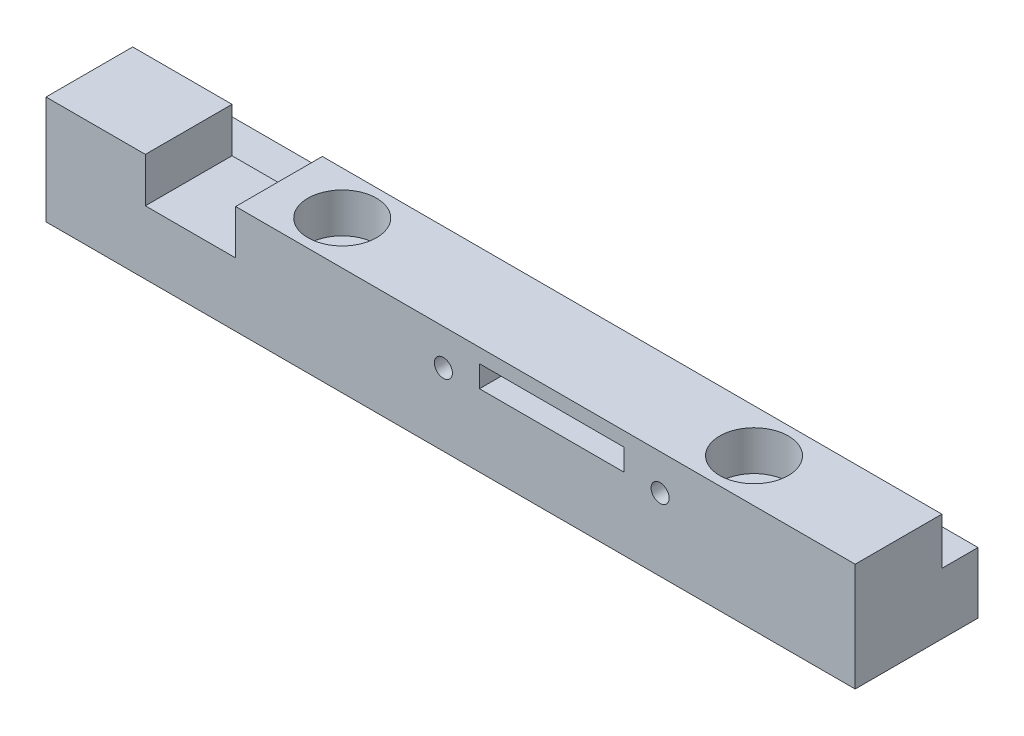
ISO-10303-21;
HEADER;
FILE_DESCRIPTION(('STEP AP214'),'2;1');
FILE_NAME('part.step','',(''),(''),'','','');
FILE_SCHEMA(('AUTOMOTIVE_DESIGN { 1 0 10303 214 1 1 1 1 }'));
ENDSEC;
DATA;
#1=APPLICATION_CONTEXT('core data for automotive mechanical design processes');
#2=APPLICATION_PROTOCOL_DEFINITION('international standard','automotive_design',2000,#1);
#3=PRODUCT_CONTEXT('',#1,'mechanical');
#4=PRODUCT('Part','Part','',(#3));
#5=PRODUCT_RELATED_PRODUCT_CATEGORY('part','',(#4));
#6=PRODUCT_DEFINITION_FORMATION('','',#4);
#7=PRODUCT_DEFINITION_CONTEXT('part definition',#1,'design');
#8=PRODUCT_DEFINITION('design','',#6,#7);
#9=PRODUCT_DEFINITION_SHAPE('','',#8);
#10=(LENGTH_UNIT() NAMED_UNIT(*) SI_UNIT(.MILLI.,.METRE.));
#11=(NAMED_UNIT(*) PLANE_ANGLE_UNIT() SI_UNIT($,.RADIAN.));
#12=(NAMED_UNIT(*) SI_UNIT($,.STERADIAN.) SOLID_ANGLE_UNIT());
#13=UNCERTAINTY_MEASURE_WITH_UNIT(LENGTH_MEASURE(1.E-05),#10,'distance_accuracy_value','');
#14=(GEOMETRIC_REPRESENTATION_CONTEXT(3) GLOBAL_UNCERTAINTY_ASSIGNED_CONTEXT((#13)) GLOBAL_UNIT_ASSIGNED_CONTEXT((#10,
#11,#12)) REPRESENTATION_CONTEXT('',''));
#15=CARTESIAN_POINT('',(0.,0.,0.));
#16=DIRECTION('',(0.,0.,1.));
#17=DIRECTION('',(1.,0.,0.));
#18=AXIS2_PLACEMENT_3D('',#15,#16,#17);
#19=CARTESIAN_POINT('',(-0.001000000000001,14.9689235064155,17.));
#20=DIRECTION('',(0.,1.,0.));
#21=DIRECTION('',(0.,0.,1.));
#22=AXIS2_PLACEMENT_3D('',#19,#20,#21);
#23=PLANE('',#22);
#24=DIRECTION('',(0.,0.,1.));
#25=VECTOR('',#24,1.);
#26=CARTESIAN_POINT('',(13.75,14.9689235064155,17.));
#27=LINE('',#26,#25);
#28=CARTESIAN_POINT('',(13.75,14.9689235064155,5.));
#29=VERTEX_POINT('',#28);
#30=CARTESIAN_POINT('',(13.75,14.9689235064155,17.));
#31=VERTEX_POINT('',#30);
#32=EDGE_CURVE('E157',#29,#31,#27,.T.);
#33=ORIENTED_EDGE('',*,*,#32,.F.);
#34=DIRECTION('',(1.,0.,0.));
#35=VECTOR('',#34,1.);
#36=CARTESIAN_POINT('',(-0.001000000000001,14.9689235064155,5.));
#37=LINE('',#36,#35);
#38=CARTESIAN_POINT('',(0.,14.9689235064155,5.));
#39=VERTEX_POINT('',#38);
#40=EDGE_CURVE('E235',#39,#29,#37,.T.);
#41=ORIENTED_EDGE('',*,*,#40,.F.);
#42=DIRECTION('',(0.,0.,-1.));
#43=VECTOR('',#42,1.);
#44=CARTESIAN_POINT('',(0.,14.9689235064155,17.));
#45=LINE('',#44,#43);
#46=CARTESIAN_POINT('',(0.,14.9689235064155,17.));
#47=VERTEX_POINT('',#46);
#48=EDGE_CURVE('E212',#47,#39,#45,.T.);
#49=ORIENTED_EDGE('',*,*,#48,.F.);
#50=DIRECTION('',(1.,0.,0.));
#51=VECTOR('',#50,1.);
#52=CARTESIAN_POINT('',(-0.001000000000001,14.9689235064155,17.));
#53=LINE('',#52,#51);
#54=EDGE_CURVE('E231',#47,#31,#53,.T.);
#55=ORIENTED_EDGE('',*,*,#54,.T.);
#56=EDGE_LOOP('',(#33,#41,#49,#55));
#57=FACE_BOUND('',#56,.T.);
#58=ADVANCED_FACE('F32',(#57),#23,.T.);
#59=CARTESIAN_POINT('',(92.,0.,11.));
#60=DIRECTION('',(0.,1.,0.));
#61=DIRECTION('',(0.,0.,1.));
#62=AXIS2_PLACEMENT_3D('',#59,#60,#61);
#63=CYLINDRICAL_SURFACE('',#62,2.75);
#64=CARTESIAN_POINT('',(92.,0.,11.));
#65=DIRECTION('',(0.,1.,0.));
#66=DIRECTION('',(0.,0.,1.));
#67=AXIS2_PLACEMENT_3D('',#64,#65,#66);
#68=CIRCLE('',#67,2.75);
#69=CARTESIAN_POINT('',(92.,0.,13.75));
#70=VERTEX_POINT('',#69);
#71=EDGE_CURVE('E196',#70,#70,#68,.T.);
#72=ORIENTED_EDGE('',*,*,#71,.F.);
#73=EDGE_LOOP('',(#72));
#74=FACE_BOUND('',#73,.T.);
#75=CARTESIAN_POINT('',(92.,9.46892350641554,11.));
#76=DIRECTION('',(0.,1.,0.));
#77=DIRECTION('',(0.,0.,1.));
#78=AXIS2_PLACEMENT_3D('',#75,#76,#77);
#79=CIRCLE('',#78,2.75);
#80=CARTESIAN_POINT('',(92.,9.46892350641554,13.75));
#81=VERTEX_POINT('',#80);
#82=EDGE_CURVE('E186',#81,#81,#79,.F.);
#83=ORIENTED_EDGE('',*,*,#82,.F.);
#84=EDGE_LOOP('',(#83));
#85=FACE_BOUND('',#84,.T.);
#86=ADVANCED_FACE('F310',(#74,#85),#63,.F.);
#87=CARTESIAN_POINT('',(35.,0.,11.));
#88=DIRECTION('',(0.,1.,0.));
#89=DIRECTION('',(0.,0.,1.));
#90=AXIS2_PLACEMENT_3D('',#87,#88,#89);
#91=CYLINDRICAL_SURFACE('',#90,2.75);
#92=CARTESIAN_POINT('',(35.,0.,11.));
#93=DIRECTION('',(0.,1.,0.));
#94=DIRECTION('',(0.,0.,1.));
#95=AXIS2_PLACEMENT_3D('',#92,#93,#94);
#96=CIRCLE('',#95,2.75);
#97=CARTESIAN_POINT('',(35.,0.,13.75));
#98=VERTEX_POINT('',#97);
#99=EDGE_CURVE('E199',#98,#98,#96,.T.);
#100=ORIENTED_EDGE('',*,*,#99,.F.);
#101=EDGE_LOOP('',(#100));
#102=FACE_BOUND('',#101,.T.);
#103=CARTESIAN_POINT('',(35.,9.46892350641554,11.));
#104=DIRECTION('',(0.,1.,0.));
#105=DIRECTION('',(0.,0.,1.));
#106=AXIS2_PLACEMENT_3D('',#103,#104,#105);
#107=CIRCLE('',#106,2.75);
#108=CARTESIAN_POINT('',(35.,9.46892350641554,13.75));
#109=VERTEX_POINT('',#108);
#110=EDGE_CURVE('E192',#109,#109,#107,.F.);
#111=ORIENTED_EDGE('',*,*,#110,.F.);
#112=EDGE_LOOP('',(#111));
#113=FACE_BOUND('',#112,.T.);
#114=ADVANCED_FACE('F317',(#102,#113),#91,.F.);
#115=CARTESIAN_POINT('',(0.,0.,17.));
#116=DIRECTION('',(0.,1.,0.));
#117=DIRECTION('',(0.,0.,1.));
#118=AXIS2_PLACEMENT_3D('',#115,#116,#117);
#119=PLANE('',#118);
#120=ORIENTED_EDGE('',*,*,#71,.T.);
#121=EDGE_LOOP('',(#120));
#122=FACE_BOUND('',#121,.T.);
#123=ORIENTED_EDGE('',*,*,#99,.T.);
#124=EDGE_LOOP('',(#123));
#125=FACE_BOUND('',#124,.T.);
#126=DIRECTION('',(1.,0.,0.));
#127=VECTOR('',#126,1.);
#128=CARTESIAN_POINT('',(0.,0.,0.));
#129=LINE('',#128,#127);
#130=CARTESIAN_POINT('',(0.,0.,0.));
#131=VERTEX_POINT('',#130);
#132=CARTESIAN_POINT('',(112.,0.,0.));
#133=VERTEX_POINT('',#132);
#134=EDGE_CURVE('E241',#131,#133,#129,.T.);
#135=ORIENTED_EDGE('',*,*,#134,.T.);
#136=DIRECTION('',(0.,0.,-1.));
#137=VECTOR('',#136,1.);
#138=CARTESIAN_POINT('',(112.,0.,17.));
#139=LINE('',#138,#137);
#140=CARTESIAN_POINT('',(112.,0.,17.));
#141=VERTEX_POINT('',#140);
#142=EDGE_CURVE('E260',#141,#133,#139,.T.);
#143=ORIENTED_EDGE('',*,*,#142,.F.);
#144=DIRECTION('',(1.,0.,0.));
#145=VECTOR('',#144,1.);
#146=CARTESIAN_POINT('',(0.,0.,17.));
#147=LINE('',#146,#145);
#148=CARTESIAN_POINT('',(0.,0.,17.));
#149=VERTEX_POINT('',#148);
#150=EDGE_CURVE('E242',#149,#141,#147,.T.);
#151=ORIENTED_EDGE('',*,*,#150,.F.);
#152=DIRECTION('',(0.,0.,-1.));
#153=VECTOR('',#152,1.);
#154=CARTESIAN_POINT('',(0.,0.,17.));
#155=LINE('',#154,#153);
#156=EDGE_CURVE('E251',#149,#131,#155,.T.);
#157=ORIENTED_EDGE('',*,*,#156,.T.);
#158=EDGE_LOOP('',(#135,#143,#151,#157));
#159=FACE_BOUND('',#158,.T.);
#160=ADVANCED_FACE('F34',(#122,#125,#159),#119,.F.);
#161=CARTESIAN_POINT('',(112.,0.,17.));
#162=DIRECTION('',(-1.,0.,0.));
#163=DIRECTION('',(0.,0.,1.));
#164=AXIS2_PLACEMENT_3D('',#161,#162,#163);
#165=PLANE('',#164);
#166=DIRECTION('',(0.,0.,1.));
#167=VECTOR('',#166,1.);
#168=CARTESIAN_POINT('',(112.,8.46892350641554,5.));
#169=LINE('',#168,#167);
#170=CARTESIAN_POINT('',(112.,8.46892350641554,0.));
#171=VERTEX_POINT('',#170);
#172=CARTESIAN_POINT('',(112.,8.46892350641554,5.));
#173=VERTEX_POINT('',#172);
#174=EDGE_CURVE('E219',#171,#173,#169,.T.);
#175=ORIENTED_EDGE('',*,*,#174,.T.);
#176=DIRECTION('',(0.,1.,0.));
#177=VECTOR('',#176,1.);
#178=CARTESIAN_POINT('',(112.,8.46892350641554,5.));
#179=LINE('',#178,#177);
#180=CARTESIAN_POINT('',(112.,14.9689235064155,5.));
#181=VERTEX_POINT('',#180);
#182=EDGE_CURVE('E221',#173,#181,#179,.T.);
#183=ORIENTED_EDGE('',*,*,#182,.T.);
#184=DIRECTION('',(0.,0.,1.));
#185=VECTOR('',#184,1.);
#186=CARTESIAN_POINT('',(112.,14.9689235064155,17.));
#187=LINE('',#186,#185);
#188=CARTESIAN_POINT('',(112.,14.9689235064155,17.));
#189=VERTEX_POINT('',#188);
#190=EDGE_CURVE('E224',#181,#189,#187,.T.);
#191=ORIENTED_EDGE('',*,*,#190,.T.);
#192=DIRECTION('',(0.,1.,0.));
#193=VECTOR('',#192,1.);
#194=CARTESIAN_POINT('',(112.,0.,17.));
#195=LINE('',#194,#193);
#196=EDGE_CURVE('E245',#141,#189,#195,.T.);
#197=ORIENTED_EDGE('',*,*,#196,.F.);
#198=ORIENTED_EDGE('',*,*,#142,.T.);
#199=DIRECTION('',(0.,1.,0.));
#200=VECTOR('',#199,1.);
#201=CARTESIAN_POINT('',(112.,0.,0.));
#202=LINE('',#201,#200);
#203=EDGE_CURVE('E254',#133,#171,#202,.T.);
#204=ORIENTED_EDGE('',*,*,#203,.T.);
#205=EDGE_LOOP('',(#175,#183,#191,#197,#198,#204));
#206=FACE_BOUND('',#205,.T.);
#207=ADVANCED_FACE('F387',(#206),#165,.F.);
#208=CARTESIAN_POINT('',(0.,0.,17.));
#209=DIRECTION('',(1.,0.,0.));
#210=DIRECTION('',(0.,0.,-1.));
#211=AXIS2_PLACEMENT_3D('',#208,#209,#210);
#212=PLANE('',#211);
#213=DIRECTION('',(0.,0.,-1.));
#214=VECTOR('',#213,1.);
#215=CARTESIAN_POINT('',(0.,8.46892350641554,5.));
#216=LINE('',#215,#214);
#217=CARTESIAN_POINT('',(0.,8.46892350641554,5.));
#218=VERTEX_POINT('',#217);
#219=CARTESIAN_POINT('',(0.,8.46892350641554,0.));
#220=VERTEX_POINT('',#219);
#221=EDGE_CURVE('E216',#218,#220,#216,.T.);
#222=ORIENTED_EDGE('',*,*,#221,.T.);
#223=DIRECTION('',(0.,-1.,0.));
#224=VECTOR('',#223,1.);
#225=CARTESIAN_POINT('',(0.,0.,0.));
#226=LINE('',#225,#224);
#227=EDGE_CURVE('E246',#220,#131,#226,.T.);
#228=ORIENTED_EDGE('',*,*,#227,.T.);
#229=ORIENTED_EDGE('',*,*,#156,.F.);
#230=DIRECTION('',(0.,-1.,0.));
#231=VECTOR('',#230,1.);
#232=CARTESIAN_POINT('',(0.,0.,17.));
#233=LINE('',#232,#231);
#234=EDGE_CURVE('E249',#47,#149,#233,.T.);
#235=ORIENTED_EDGE('',*,*,#234,.F.);
#236=ORIENTED_EDGE('',*,*,#48,.T.);
#237=DIRECTION('',(0.,-1.,0.));
#238=VECTOR('',#237,1.);
#239=CARTESIAN_POINT('',(0.,8.46892350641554,5.));
#240=LINE('',#239,#238);
#241=EDGE_CURVE('E230',#39,#218,#240,.T.);
#242=ORIENTED_EDGE('',*,*,#241,.T.);
#243=EDGE_LOOP('',(#222,#228,#229,#235,#236,#242));
#244=FACE_BOUND('',#243,.T.);
#245=ADVANCED_FACE('F379',(#244),#212,.F.);
#246=CARTESIAN_POINT('',(112.,0.,17.));
#247=DIRECTION('',(0.,0.,1.));
#248=DIRECTION('',(1.,0.,0.));
#249=AXIS2_PLACEMENT_3D('',#246,#247,#248);
#250=PLANE('',#249);
#251=DIRECTION('',(0.,-1.,0.));
#252=VECTOR('',#251,1.);
#253=CARTESIAN_POINT('',(13.75,0.,17.));
#254=LINE('',#253,#252);
#255=CARTESIAN_POINT('',(13.75,8.79999999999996,17.));
#256=VERTEX_POINT('',#255);
#257=EDGE_CURVE('E160',#31,#256,#254,.T.);
#258=ORIENTED_EDGE('',*,*,#257,.F.);
#259=ORIENTED_EDGE('',*,*,#54,.F.);
#260=ORIENTED_EDGE('',*,*,#234,.T.);
#261=ORIENTED_EDGE('',*,*,#150,.T.);
#262=ORIENTED_EDGE('',*,*,#196,.T.);
#263=CARTESIAN_POINT('',(26.25,14.9689235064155,17.));
#264=VERTEX_POINT('',#263);
#265=EDGE_CURVE('E234',#264,#189,#53,.T.);
#266=ORIENTED_EDGE('',*,*,#265,.F.);
#267=DIRECTION('',(0.,1.,0.));
#268=VECTOR('',#267,1.);
#269=CARTESIAN_POINT('',(26.25,0.,17.));
#270=LINE('',#269,#268);
#271=CARTESIAN_POINT('',(26.25,8.79999999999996,17.));
#272=VERTEX_POINT('',#271);
#273=EDGE_CURVE('E52',#272,#264,#270,.T.);
#274=ORIENTED_EDGE('',*,*,#273,.F.);
#275=DIRECTION('',(1.,0.,0.));
#276=VECTOR('',#275,1.);
#277=CARTESIAN_POINT('',(112.,8.79999999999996,17.));
#278=LINE('',#277,#276);
#279=EDGE_CURVE('E47',#256,#272,#278,.T.);
#280=ORIENTED_EDGE('',*,*,#279,.F.);
#281=EDGE_LOOP('',(#258,#259,#260,#261,#262,#266,#274,#280));
#282=FACE_BOUND('',#281,.T.);
#283=DIRECTION('',(0.,-1.,0.));
#284=VECTOR('',#283,1.);
#285=CARTESIAN_POINT('',(60.0000000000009,10.,17.));
#286=LINE('',#285,#284);
#287=CARTESIAN_POINT('',(60.0000000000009,13.,17.));
#288=VERTEX_POINT('',#287);
#289=CARTESIAN_POINT('',(60.0000000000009,10.,17.));
#290=VERTEX_POINT('',#289);
#291=EDGE_CURVE('E162',#288,#290,#286,.T.);
#292=ORIENTED_EDGE('',*,*,#291,.F.);
#293=DIRECTION('',(-1.,0.,0.));
#294=VECTOR('',#293,1.);
#295=CARTESIAN_POINT('',(60.0000000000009,13.,17.));
#296=LINE('',#295,#294);
#297=CARTESIAN_POINT('',(80.0000000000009,13.,17.));
#298=VERTEX_POINT('',#297);
#299=EDGE_CURVE('E170',#298,#288,#296,.T.);
#300=ORIENTED_EDGE('',*,*,#299,.F.);
#301=DIRECTION('',(0.,1.,0.));
#302=VECTOR('',#301,1.);
#303=CARTESIAN_POINT('',(80.0000000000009,10.,17.));
#304=LINE('',#303,#302);
#305=CARTESIAN_POINT('',(80.0000000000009,10.,17.));
#306=VERTEX_POINT('',#305);
#307=EDGE_CURVE('E167',#306,#298,#304,.T.);
#308=ORIENTED_EDGE('',*,*,#307,.F.);
#309=DIRECTION('',(1.,0.,0.));
#310=VECTOR('',#309,1.);
#311=CARTESIAN_POINT('',(60.0000000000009,10.,17.));
#312=LINE('',#311,#310);
#313=EDGE_CURVE('E164',#290,#306,#312,.T.);
#314=ORIENTED_EDGE('',*,*,#313,.F.);
#315=EDGE_LOOP('',(#292,#300,#308,#314));
#316=FACE_BOUND('',#315,.T.);
#317=CARTESIAN_POINT('',(55.0000000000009,10.0000000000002,17.));
#318=DIRECTION('',(0.,0.,1.));
#319=DIRECTION('',(1.,0.,0.));
#320=AXIS2_PLACEMENT_3D('',#317,#318,#319);
#321=CIRCLE('',#320,1.25);
#322=CARTESIAN_POINT('',(56.2500000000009,10.0000000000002,17.));
#323=VERTEX_POINT('',#322);
#324=EDGE_CURVE('E202',#323,#323,#321,.T.);
#325=ORIENTED_EDGE('',*,*,#324,.F.);
#326=EDGE_LOOP('',(#325));
#327=FACE_BOUND('',#326,.T.);
#328=CARTESIAN_POINT('',(85.0000000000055,10.,17.));
#329=DIRECTION('',(0.,0.,1.));
#330=DIRECTION('',(1.,0.,0.));
#331=AXIS2_PLACEMENT_3D('',#328,#329,#330);
#332=CIRCLE('',#331,1.25);
#333=CARTESIAN_POINT('',(86.2500000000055,10.,17.));
#334=VERTEX_POINT('',#333);
#335=EDGE_CURVE('E206',#334,#334,#332,.T.);
#336=ORIENTED_EDGE('',*,*,#335,.F.);
#337=EDGE_LOOP('',(#336));
#338=FACE_BOUND('',#337,.T.);
#339=ADVANCED_FACE('F292',(#282,#316,#327,#338),#250,.T.);
#340=CARTESIAN_POINT('',(112.,0.,0.));
#341=DIRECTION('',(0.,0.,1.));
#342=DIRECTION('',(1.,0.,0.));
#343=AXIS2_PLACEMENT_3D('',#340,#341,#342);
#344=PLANE('',#343);
#345=DIRECTION('',(1.,0.,0.));
#346=VECTOR('',#345,1.);
#347=CARTESIAN_POINT('',(-0.001000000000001,8.46892350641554,0.));
#348=LINE('',#347,#346);
#349=EDGE_CURVE('E228',#220,#171,#348,.T.);
#350=ORIENTED_EDGE('',*,*,#349,.T.);
#351=ORIENTED_EDGE('',*,*,#203,.F.);
#352=ORIENTED_EDGE('',*,*,#134,.F.);
#353=ORIENTED_EDGE('',*,*,#227,.F.);
#354=EDGE_LOOP('',(#350,#351,#352,#353));
#355=FACE_BOUND('',#354,.T.);
#356=ADVANCED_FACE('F330',(#355),#344,.F.);
#357=CARTESIAN_POINT('',(-0.001000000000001,8.46892350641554,5.));
#358=DIRECTION('',(0.,1.,0.));
#359=DIRECTION('',(0.,0.,1.));
#360=AXIS2_PLACEMENT_3D('',#357,#358,#359);
#361=PLANE('',#360);
#362=ORIENTED_EDGE('',*,*,#221,.F.);
#363=DIRECTION('',(1.,0.,0.));
#364=VECTOR('',#363,1.);
#365=CARTESIAN_POINT('',(-0.001000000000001,8.46892350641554,5.));
#366=LINE('',#365,#364);
#367=EDGE_CURVE('E227',#218,#173,#366,.T.);
#368=ORIENTED_EDGE('',*,*,#367,.T.);
#369=ORIENTED_EDGE('',*,*,#174,.F.);
#370=ORIENTED_EDGE('',*,*,#349,.F.);
#371=EDGE_LOOP('',(#362,#368,#369,#370));
#372=FACE_BOUND('',#371,.T.);
#373=ADVANCED_FACE('F323',(#372),#361,.T.);
#374=DIRECTION('',(0.,0.,-1.));
#375=VECTOR('',#374,1.);
#376=CARTESIAN_POINT('',(26.25,14.9689235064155,17.));
#377=LINE('',#376,#375);
#378=CARTESIAN_POINT('',(26.25,14.9689235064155,5.));
#379=VERTEX_POINT('',#378);
#380=EDGE_CURVE('E146',#264,#379,#377,.T.);
#381=ORIENTED_EDGE('',*,*,#380,.F.);
#382=ORIENTED_EDGE('',*,*,#265,.T.);
#383=ORIENTED_EDGE('',*,*,#190,.F.);
#384=EDGE_CURVE('E237',#379,#181,#37,.T.);
#385=ORIENTED_EDGE('',*,*,#384,.F.);
#386=EDGE_LOOP('',(#381,#382,#383,#385));
#387=FACE_BOUND('',#386,.T.);
#388=CARTESIAN_POINT('',(92.,14.9689235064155,11.));
#389=DIRECTION('',(0.,1.,0.));
#390=DIRECTION('',(0.,0.,1.));
#391=AXIS2_PLACEMENT_3D('',#388,#389,#390);
#392=CIRCLE('',#391,4.75);
#393=CARTESIAN_POINT('',(92.,14.9689235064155,15.75));
#394=VERTEX_POINT('',#393);
#395=EDGE_CURVE('E176',#394,#394,#392,.T.);
#396=ORIENTED_EDGE('',*,*,#395,.F.);
#397=EDGE_LOOP('',(#396));
#398=FACE_BOUND('',#397,.T.);
#399=CARTESIAN_POINT('',(35.,14.9689235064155,11.));
#400=DIRECTION('',(0.,1.,0.));
#401=DIRECTION('',(0.,0.,1.));
#402=AXIS2_PLACEMENT_3D('',#399,#400,#401);
#403=CIRCLE('',#402,4.75);
#404=CARTESIAN_POINT('',(35.,14.9689235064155,15.75));
#405=VERTEX_POINT('',#404);
#406=EDGE_CURVE('E193',#405,#405,#403,.T.);
#407=ORIENTED_EDGE('',*,*,#406,.F.);
#408=EDGE_LOOP('',(#407));
#409=FACE_BOUND('',#408,.T.);
#410=ADVANCED_FACE('F313',(#387,#398,#409),#23,.T.);
#411=CARTESIAN_POINT('',(-0.001000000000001,8.46892350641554,5.));
#412=DIRECTION('',(0.,0.,-1.));
#413=DIRECTION('',(-1.,0.,0.));
#414=AXIS2_PLACEMENT_3D('',#411,#412,#413);
#415=PLANE('',#414);
#416=DIRECTION('',(0.,1.,0.));
#417=VECTOR('',#416,1.);
#418=CARTESIAN_POINT('',(13.75,8.46892350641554,5.));
#419=LINE('',#418,#417);
#420=CARTESIAN_POINT('',(13.75,8.79999999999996,5.));
#421=VERTEX_POINT('',#420);
#422=EDGE_CURVE('E11',#421,#29,#419,.T.);
#423=ORIENTED_EDGE('',*,*,#422,.F.);
#424=DIRECTION('',(-1.,0.,0.));
#425=VECTOR('',#424,1.);
#426=CARTESIAN_POINT('',(-0.001000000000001,8.79999999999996,5.));
#427=LINE('',#426,#425);
#428=CARTESIAN_POINT('',(26.25,8.79999999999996,5.));
#429=VERTEX_POINT('',#428);
#430=EDGE_CURVE('E40',#429,#421,#427,.T.);
#431=ORIENTED_EDGE('',*,*,#430,.F.);
#432=DIRECTION('',(0.,-1.,0.));
#433=VECTOR('',#432,1.);
#434=CARTESIAN_POINT('',(26.25,8.46892350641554,5.));
#435=LINE('',#434,#433);
#436=EDGE_CURVE('E134',#379,#429,#435,.T.);
#437=ORIENTED_EDGE('',*,*,#436,.F.);
#438=ORIENTED_EDGE('',*,*,#384,.T.);
#439=ORIENTED_EDGE('',*,*,#182,.F.);
#440=ORIENTED_EDGE('',*,*,#367,.F.);
#441=ORIENTED_EDGE('',*,*,#241,.F.);
#442=ORIENTED_EDGE('',*,*,#40,.T.);
#443=EDGE_LOOP('',(#423,#431,#437,#438,#439,#440,#441,#442));
#444=FACE_BOUND('',#443,.T.);
#445=DIRECTION('',(0.,1.,0.));
#446=VECTOR('',#445,1.);
#447=CARTESIAN_POINT('',(60.0000000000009,8.46892350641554,5.));
#448=LINE('',#447,#446);
#449=CARTESIAN_POINT('',(60.0000000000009,10.,5.));
#450=VERTEX_POINT('',#449);
#451=CARTESIAN_POINT('',(60.0000000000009,13.,5.));
#452=VERTEX_POINT('',#451);
#453=EDGE_CURVE('E147',#450,#452,#448,.T.);
#454=ORIENTED_EDGE('',*,*,#453,.F.);
#455=DIRECTION('',(-1.,0.,0.));
#456=VECTOR('',#455,1.);
#457=CARTESIAN_POINT('',(-0.001000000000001,10.,5.));
#458=LINE('',#457,#456);
#459=CARTESIAN_POINT('',(80.0000000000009,10.,5.));
#460=VERTEX_POINT('',#459);
#461=EDGE_CURVE('E263',#460,#450,#458,.T.);
#462=ORIENTED_EDGE('',*,*,#461,.F.);
#463=DIRECTION('',(0.,-1.,0.));
#464=VECTOR('',#463,1.);
#465=CARTESIAN_POINT('',(80.0000000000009,8.46892350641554,5.));
#466=LINE('',#465,#464);
#467=CARTESIAN_POINT('',(80.0000000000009,13.,5.));
#468=VERTEX_POINT('',#467);
#469=EDGE_CURVE('E269',#468,#460,#466,.T.);
#470=ORIENTED_EDGE('',*,*,#469,.F.);
#471=DIRECTION('',(1.,0.,0.));
#472=VECTOR('',#471,1.);
#473=CARTESIAN_POINT('',(-0.001000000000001,13.,5.));
#474=LINE('',#473,#472);
#475=EDGE_CURVE('E272',#452,#468,#474,.T.);
#476=ORIENTED_EDGE('',*,*,#475,.F.);
#477=EDGE_LOOP('',(#454,#462,#470,#476));
#478=FACE_BOUND('',#477,.T.);
#479=ADVANCED_FACE('F132',(#444,#478),#415,.T.);
#480=CARTESIAN_POINT('',(85.0000000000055,10.,9.));
#481=DIRECTION('',(0.,0.,1.));
#482=DIRECTION('',(1.,0.,0.));
#483=AXIS2_PLACEMENT_3D('',#480,#481,#482);
#484=CYLINDRICAL_SURFACE('',#483,1.25);
#485=CARTESIAN_POINT('',(85.0000000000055,10.,9.));
#486=DIRECTION('',(0.,0.,1.));
#487=DIRECTION('',(1.,0.,0.));
#488=AXIS2_PLACEMENT_3D('',#485,#486,#487);
#489=CIRCLE('',#488,1.25);
#490=CARTESIAN_POINT('',(86.2500000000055,10.,9.));
#491=VERTEX_POINT('',#490);
#492=EDGE_CURVE('E209',#491,#491,#489,.T.);
#493=ORIENTED_EDGE('',*,*,#492,.F.);
#494=EDGE_LOOP('',(#493));
#495=FACE_BOUND('',#494,.T.);
#496=ORIENTED_EDGE('',*,*,#335,.T.);
#497=EDGE_LOOP('',(#496));
#498=FACE_BOUND('',#497,.T.);
#499=ADVANCED_FACE('F329',(#495,#498),#484,.F.);
#500=CARTESIAN_POINT('',(85.0000000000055,10.,9.));
#501=DIRECTION('',(0.,0.,1.));
#502=DIRECTION('',(1.,0.,0.));
#503=AXIS2_PLACEMENT_3D('',#500,#501,#502);
#504=PLANE('',#503);
#505=ORIENTED_EDGE('',*,*,#492,.T.);
#506=EDGE_LOOP('',(#505));
#507=FACE_BOUND('',#506,.T.);
#508=ADVANCED_FACE('F366',(#507),#504,.T.);
#509=CARTESIAN_POINT('',(55.0000000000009,10.0000000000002,9.));
#510=DIRECTION('',(0.,0.,1.));
#511=DIRECTION('',(1.,0.,0.));
#512=AXIS2_PLACEMENT_3D('',#509,#510,#511);
#513=CYLINDRICAL_SURFACE('',#512,1.25);
#514=CARTESIAN_POINT('',(55.0000000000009,10.0000000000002,9.));
#515=DIRECTION('',(0.,0.,1.));
#516=DIRECTION('',(1.,0.,0.));
#517=AXIS2_PLACEMENT_3D('',#514,#515,#516);
#518=CIRCLE('',#517,1.25);
#519=CARTESIAN_POINT('',(56.2500000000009,10.0000000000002,9.));
#520=VERTEX_POINT('',#519);
#521=EDGE_CURVE('E203',#520,#520,#518,.T.);
#522=ORIENTED_EDGE('',*,*,#521,.F.);
#523=EDGE_LOOP('',(#522));
#524=FACE_BOUND('',#523,.T.);
#525=ORIENTED_EDGE('',*,*,#324,.T.);
#526=EDGE_LOOP('',(#525));
#527=FACE_BOUND('',#526,.T.);
#528=ADVANCED_FACE('F362',(#524,#527),#513,.F.);
#529=CARTESIAN_POINT('',(55.0000000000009,10.0000000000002,9.));
#530=DIRECTION('',(0.,0.,1.));
#531=DIRECTION('',(1.,0.,0.));
#532=AXIS2_PLACEMENT_3D('',#529,#530,#531);
#533=PLANE('',#532);
#534=ORIENTED_EDGE('',*,*,#521,.T.);
#535=EDGE_LOOP('',(#534));
#536=FACE_BOUND('',#535,.T.);
#537=ADVANCED_FACE('F351',(#536),#533,.T.);
#538=CARTESIAN_POINT('',(35.,9.46892350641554,11.));
#539=DIRECTION('',(0.,1.,0.));
#540=DIRECTION('',(0.,0.,1.));
#541=AXIS2_PLACEMENT_3D('',#538,#539,#540);
#542=PLANE('',#541);
#543=CARTESIAN_POINT('',(35.,9.46892350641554,11.));
#544=DIRECTION('',(0.,1.,0.));
#545=DIRECTION('',(0.,0.,1.));
#546=AXIS2_PLACEMENT_3D('',#543,#544,#545);
#547=CIRCLE('',#546,4.75);
#548=CARTESIAN_POINT('',(35.,9.46892350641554,15.75));
#549=VERTEX_POINT('',#548);
#550=EDGE_CURVE('E189',#549,#549,#547,.T.);
#551=ORIENTED_EDGE('',*,*,#550,.T.);
#552=EDGE_LOOP('',(#551));
#553=FACE_BOUND('',#552,.T.);
#554=ORIENTED_EDGE('',*,*,#110,.T.);
#555=EDGE_LOOP('',(#554));
#556=FACE_BOUND('',#555,.T.);
#557=ADVANCED_FACE('F341',(#553,#556),#542,.T.);
#558=CARTESIAN_POINT('',(35.,9.46892350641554,11.));
#559=DIRECTION('',(0.,1.,0.));
#560=DIRECTION('',(0.,0.,1.));
#561=AXIS2_PLACEMENT_3D('',#558,#559,#560);
#562=CYLINDRICAL_SURFACE('',#561,4.75);
#563=ORIENTED_EDGE('',*,*,#550,.F.);
#564=EDGE_LOOP('',(#563));
#565=FACE_BOUND('',#564,.T.);
#566=ORIENTED_EDGE('',*,*,#406,.T.);
#567=EDGE_LOOP('',(#566));
#568=FACE_BOUND('',#567,.T.);
#569=ADVANCED_FACE('F338',(#565,#568),#562,.F.);
#570=CARTESIAN_POINT('',(92.,9.46892350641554,11.));
#571=DIRECTION('',(0.,1.,0.));
#572=DIRECTION('',(0.,0.,1.));
#573=AXIS2_PLACEMENT_3D('',#570,#571,#572);
#574=PLANE('',#573);
#575=CARTESIAN_POINT('',(92.,9.46892350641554,11.));
#576=DIRECTION('',(0.,1.,0.));
#577=DIRECTION('',(0.,0.,1.));
#578=AXIS2_PLACEMENT_3D('',#575,#576,#577);
#579=CIRCLE('',#578,4.75);
#580=CARTESIAN_POINT('',(92.,9.46892350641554,15.75));
#581=VERTEX_POINT('',#580);
#582=EDGE_CURVE('E183',#581,#581,#579,.T.);
#583=ORIENTED_EDGE('',*,*,#582,.T.);
#584=EDGE_LOOP('',(#583));
#585=FACE_BOUND('',#584,.T.);
#586=ORIENTED_EDGE('',*,*,#82,.T.);
#587=EDGE_LOOP('',(#586));
#588=FACE_BOUND('',#587,.T.);
#589=ADVANCED_FACE('F340',(#585,#588),#574,.T.);
#590=CARTESIAN_POINT('',(92.,9.46892350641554,11.));
#591=DIRECTION('',(0.,1.,0.));
#592=DIRECTION('',(0.,0.,1.));
#593=AXIS2_PLACEMENT_3D('',#590,#591,#592);
#594=CYLINDRICAL_SURFACE('',#593,4.75);
#595=ORIENTED_EDGE('',*,*,#582,.F.);
#596=EDGE_LOOP('',(#595));
#597=FACE_BOUND('',#596,.T.);
#598=ORIENTED_EDGE('',*,*,#395,.T.);
#599=EDGE_LOOP('',(#598));
#600=FACE_BOUND('',#599,.T.);
#601=ADVANCED_FACE('F348',(#597,#600),#594,.F.);
#602=CARTESIAN_POINT('',(60.0000000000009,10.,0.));
#603=DIRECTION('',(-1.,0.,0.));
#604=DIRECTION('',(0.,0.,1.));
#605=AXIS2_PLACEMENT_3D('',#602,#603,#604);
#606=PLANE('',#605);
#607=ORIENTED_EDGE('',*,*,#453,.T.);
#608=DIRECTION('',(0.,0.,1.));
#609=VECTOR('',#608,1.);
#610=CARTESIAN_POINT('',(60.0000000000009,13.,0.));
#611=LINE('',#610,#609);
#612=EDGE_CURVE('E174',#452,#288,#611,.T.);
#613=ORIENTED_EDGE('',*,*,#612,.T.);
#614=ORIENTED_EDGE('',*,*,#291,.T.);
#615=DIRECTION('',(0.,0.,1.));
#616=VECTOR('',#615,1.);
#617=CARTESIAN_POINT('',(60.0000000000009,10.,0.));
#618=LINE('',#617,#616);
#619=EDGE_CURVE('E173',#450,#290,#618,.T.);
#620=ORIENTED_EDGE('',*,*,#619,.F.);
#621=EDGE_LOOP('',(#607,#613,#614,#620));
#622=FACE_BOUND('',#621,.T.);
#623=ADVANCED_FACE('F278',(#622),#606,.F.);
#624=CARTESIAN_POINT('',(60.0000000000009,13.,0.));
#625=DIRECTION('',(0.,1.,0.));
#626=DIRECTION('',(0.,0.,1.));
#627=AXIS2_PLACEMENT_3D('',#624,#625,#626);
#628=PLANE('',#627);
#629=ORIENTED_EDGE('',*,*,#475,.T.);
#630=DIRECTION('',(0.,0.,1.));
#631=VECTOR('',#630,1.);
#632=CARTESIAN_POINT('',(80.0000000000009,13.,0.));
#633=LINE('',#632,#631);
#634=EDGE_CURVE('E177',#468,#298,#633,.T.);
#635=ORIENTED_EDGE('',*,*,#634,.T.);
#636=ORIENTED_EDGE('',*,*,#299,.T.);
#637=ORIENTED_EDGE('',*,*,#612,.F.);
#638=EDGE_LOOP('',(#629,#635,#636,#637));
#639=FACE_BOUND('',#638,.T.);
#640=ADVANCED_FACE('F282',(#639),#628,.F.);
#641=CARTESIAN_POINT('',(80.0000000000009,10.,0.));
#642=DIRECTION('',(1.,0.,0.));
#643=DIRECTION('',(0.,0.,-1.));
#644=AXIS2_PLACEMENT_3D('',#641,#642,#643);
#645=PLANE('',#644);
#646=ORIENTED_EDGE('',*,*,#469,.T.);
#647=DIRECTION('',(0.,0.,1.));
#648=VECTOR('',#647,1.);
#649=CARTESIAN_POINT('',(80.0000000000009,10.,0.));
#650=LINE('',#649,#648);
#651=EDGE_CURVE('E179',#460,#306,#650,.T.);
#652=ORIENTED_EDGE('',*,*,#651,.T.);
#653=ORIENTED_EDGE('',*,*,#307,.T.);
#654=ORIENTED_EDGE('',*,*,#634,.F.);
#655=EDGE_LOOP('',(#646,#652,#653,#654));
#656=FACE_BOUND('',#655,.T.);
#657=ADVANCED_FACE('F288',(#656),#645,.F.);
#658=CARTESIAN_POINT('',(60.0000000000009,10.,0.));
#659=DIRECTION('',(0.,-1.,0.));
#660=DIRECTION('',(0.,0.,-1.));
#661=AXIS2_PLACEMENT_3D('',#658,#659,#660);
#662=PLANE('',#661);
#663=ORIENTED_EDGE('',*,*,#461,.T.);
#664=ORIENTED_EDGE('',*,*,#619,.T.);
#665=ORIENTED_EDGE('',*,*,#313,.T.);
#666=ORIENTED_EDGE('',*,*,#651,.F.);
#667=EDGE_LOOP('',(#663,#664,#665,#666));
#668=FACE_BOUND('',#667,.T.);
#669=ADVANCED_FACE('F295',(#668),#662,.F.);
#670=CARTESIAN_POINT('',(13.75,14.9999999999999,163.896913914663));
#671=DIRECTION('',(-1.,0.,0.));
#672=DIRECTION('',(0.,0.,1.));
#673=AXIS2_PLACEMENT_3D('',#670,#671,#672);
#674=PLANE('',#673);
#675=ORIENTED_EDGE('',*,*,#32,.T.);
#676=ORIENTED_EDGE('',*,*,#257,.T.);
#677=DIRECTION('',(0.,0.,-1.));
#678=VECTOR('',#677,1.);
#679=CARTESIAN_POINT('',(13.75,8.79999999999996,163.896913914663));
#680=LINE('',#679,#678);
#681=EDGE_CURVE('E150',#256,#421,#680,.T.);
#682=ORIENTED_EDGE('',*,*,#681,.T.);
#683=ORIENTED_EDGE('',*,*,#422,.T.);
#684=EDGE_LOOP('',(#675,#676,#682,#683));
#685=FACE_BOUND('',#684,.T.);
#686=ADVANCED_FACE('F297',(#685),#674,.F.);
#687=CARTESIAN_POINT('',(13.75,8.79999999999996,163.896913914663));
#688=DIRECTION('',(0.,-1.,0.));
#689=DIRECTION('',(0.,0.,-1.));
#690=AXIS2_PLACEMENT_3D('',#687,#688,#689);
#691=PLANE('',#690);
#692=ORIENTED_EDGE('',*,*,#681,.F.);
#693=ORIENTED_EDGE('',*,*,#279,.T.);
#694=DIRECTION('',(0.,0.,-1.));
#695=VECTOR('',#694,1.);
#696=CARTESIAN_POINT('',(26.25,8.79999999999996,163.896913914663));
#697=LINE('',#696,#695);
#698=EDGE_CURVE('E145',#272,#429,#697,.T.);
#699=ORIENTED_EDGE('',*,*,#698,.T.);
#700=ORIENTED_EDGE('',*,*,#430,.T.);
#701=EDGE_LOOP('',(#692,#693,#699,#700));
#702=FACE_BOUND('',#701,.T.);
#703=ADVANCED_FACE('F149',(#702),#691,.F.);
#704=CARTESIAN_POINT('',(26.25,15.,163.896913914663));
#705=DIRECTION('',(1.,0.,0.));
#706=DIRECTION('',(0.,0.,-1.));
#707=AXIS2_PLACEMENT_3D('',#704,#705,#706);
#708=PLANE('',#707);
#709=ORIENTED_EDGE('',*,*,#698,.F.);
#710=ORIENTED_EDGE('',*,*,#273,.T.);
#711=ORIENTED_EDGE('',*,*,#380,.T.);
#712=ORIENTED_EDGE('',*,*,#436,.T.);
#713=EDGE_LOOP('',(#709,#710,#711,#712));
#714=FACE_BOUND('',#713,.T.);
#715=ADVANCED_FACE('F144',(#714),#708,.F.);
#716=CLOSED_SHELL('',(#58,#86,#114,#160,#207,#245,#339,#356,#373,#410,#479,#499,#508,#528,#537,
#557,#569,#589,#601,#623,#640,#657,#669,#686,#703,#715));
#717=MANIFOLD_SOLID_BREP('B2',#716);
#718=ADVANCED_BREP_SHAPE_REPRESENTATION('',(#18,#717),#14);
#719=SHAPE_DEFINITION_REPRESENTATION(#9,#718);
ENDSEC;
END-ISO-10303-21;
